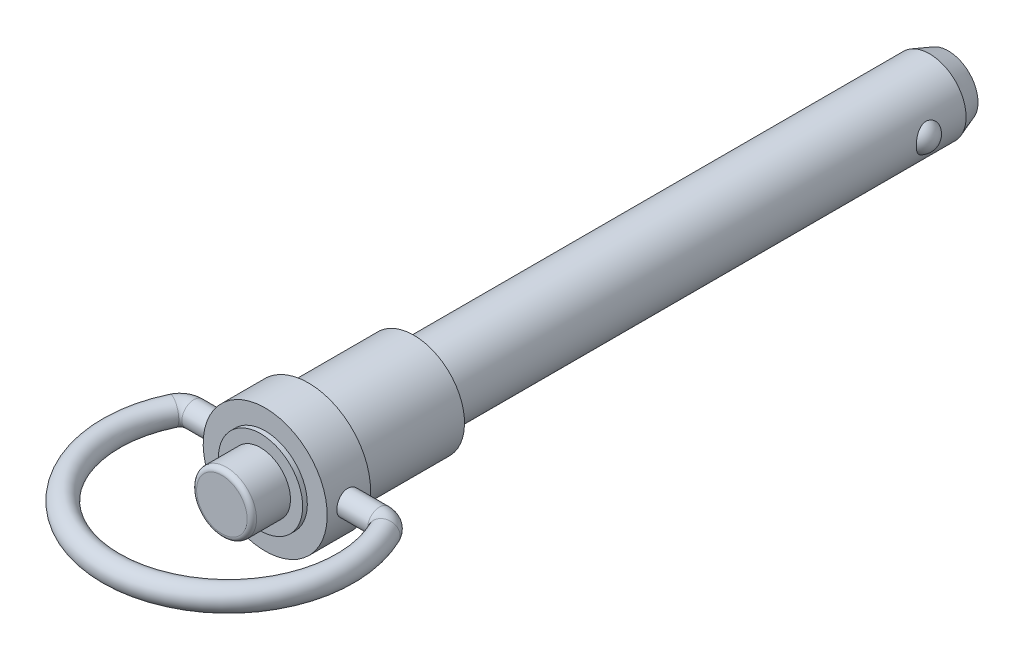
ISO-10303-21;
HEADER;
FILE_DESCRIPTION(('STEP AP214'),'2;1');
FILE_NAME('part.step','',(''),(''),'','','');
FILE_SCHEMA(('AUTOMOTIVE_DESIGN { 1 0 10303 214 1 1 1 1 }'));
ENDSEC;
DATA;
#1=APPLICATION_CONTEXT('core data for automotive mechanical design processes');
#2=APPLICATION_PROTOCOL_DEFINITION('international standard','automotive_design',2000,#1);
#3=PRODUCT_CONTEXT('',#1,'mechanical');
#4=PRODUCT('Part','Part','',(#3));
#5=PRODUCT_RELATED_PRODUCT_CATEGORY('part','',(#4));
#6=PRODUCT_DEFINITION_FORMATION('','',#4);
#7=PRODUCT_DEFINITION_CONTEXT('part definition',#1,'design');
#8=PRODUCT_DEFINITION('design','',#6,#7);
#9=PRODUCT_DEFINITION_SHAPE('','',#8);
#10=(LENGTH_UNIT() NAMED_UNIT(*) SI_UNIT(.MILLI.,.METRE.));
#11=(NAMED_UNIT(*) PLANE_ANGLE_UNIT() SI_UNIT($,.RADIAN.));
#12=(NAMED_UNIT(*) SI_UNIT($,.STERADIAN.) SOLID_ANGLE_UNIT());
#13=UNCERTAINTY_MEASURE_WITH_UNIT(LENGTH_MEASURE(1.E-05),#10,'distance_accuracy_value','');
#14=(GEOMETRIC_REPRESENTATION_CONTEXT(3) GLOBAL_UNCERTAINTY_ASSIGNED_CONTEXT((#13)) GLOBAL_UNIT_ASSIGNED_CONTEXT((#10,
#11,#12)) REPRESENTATION_CONTEXT('',''));
#15=CARTESIAN_POINT('',(0.,0.,0.));
#16=DIRECTION('',(0.,0.,1.));
#17=DIRECTION('',(1.,0.,0.));
#18=AXIS2_PLACEMENT_3D('',#15,#16,#17);
#19=CARTESIAN_POINT('',(0.,0.,20.828));
#20=DIRECTION('',(0.,0.,1.));
#21=DIRECTION('',(0.,-1.,0.));
#22=AXIS2_PLACEMENT_3D('',#19,#20,#21);
#23=PLANE('',#22);
#24=CARTESIAN_POINT('',(0.,0.,20.828));
#25=DIRECTION('',(0.,0.,-1.));
#26=DIRECTION('',(0.,1.,0.));
#27=AXIS2_PLACEMENT_3D('',#24,#25,#26);
#28=CIRCLE('',#27,2.7432);
#29=CARTESIAN_POINT('',(0.,2.7432,20.828));
#30=VERTEX_POINT('',#29);
#31=CARTESIAN_POINT('',(0.,-2.7432,20.828));
#32=VERTEX_POINT('',#31);
#33=EDGE_CURVE('E36',#30,#32,#28,.T.);
#34=ORIENTED_EDGE('',*,*,#33,.F.);
#35=CARTESIAN_POINT('',(0.,0.,20.828));
#36=DIRECTION('',(0.,0.,-1.));
#37=DIRECTION('',(0.,-1.,0.));
#38=AXIS2_PLACEMENT_3D('',#35,#36,#37);
#39=CIRCLE('',#38,2.7432);
#40=EDGE_CURVE('E29',#32,#30,#39,.T.);
#41=ORIENTED_EDGE('',*,*,#40,.F.);
#42=EDGE_LOOP('',(#34,#41));
#43=FACE_BOUND('',#42,.T.);
#44=ADVANCED_FACE('F15',(#43),#23,.T.);
#45=CARTESIAN_POINT('',(0.,0.,20.32));
#46=DIRECTION('',(0.,0.,1.));
#47=DIRECTION('',(0.,-1.,0.));
#48=AXIS2_PLACEMENT_3D('',#45,#46,#47);
#49=TOROIDAL_SURFACE('',#48,2.7432,0.508);
#50=ORIENTED_EDGE('',*,*,#40,.T.);
#51=ORIENTED_EDGE('',*,*,#33,.T.);
#52=EDGE_LOOP('',(#50,#51));
#53=FACE_BOUND('',#52,.T.);
#54=CARTESIAN_POINT('',(0.,0.,20.32));
#55=DIRECTION('',(0.,0.,-1.));
#56=DIRECTION('',(0.,1.,0.));
#57=AXIS2_PLACEMENT_3D('',#54,#55,#56);
#58=CIRCLE('',#57,3.2512);
#59=CARTESIAN_POINT('',(0.,3.2512,20.32));
#60=VERTEX_POINT('',#59);
#61=EDGE_CURVE('E114',#60,#60,#58,.T.);
#62=ORIENTED_EDGE('',*,*,#61,.F.);
#63=EDGE_LOOP('',(#62));
#64=FACE_BOUND('',#63,.T.);
#65=ADVANCED_FACE('F34',(#53,#64),#49,.T.);
#66=CARTESIAN_POINT('',(0.,0.,20.828));
#67=DIRECTION('',(0.,0.,-1.));
#68=DIRECTION('',(0.,1.,0.));
#69=AXIS2_PLACEMENT_3D('',#66,#67,#68);
#70=CYLINDRICAL_SURFACE('',#69,3.2512);
#71=CARTESIAN_POINT('',(0.,0.,16.637));
#72=DIRECTION('',(0.,0.,-1.));
#73=DIRECTION('',(0.,1.,0.));
#74=AXIS2_PLACEMENT_3D('',#71,#72,#73);
#75=CIRCLE('',#74,3.2512);
#76=CARTESIAN_POINT('',(0.,3.2512,16.637));
#77=VERTEX_POINT('',#76);
#78=EDGE_CURVE('E107',#77,#77,#75,.T.);
#79=ORIENTED_EDGE('',*,*,#78,.F.);
#80=EDGE_LOOP('',(#79));
#81=FACE_BOUND('',#80,.T.);
#82=ORIENTED_EDGE('',*,*,#61,.T.);
#83=EDGE_LOOP('',(#82));
#84=FACE_BOUND('',#83,.T.);
#85=ADVANCED_FACE('F90',(#81,#84),#70,.T.);
#86=CARTESIAN_POINT('',(4.572,0.,16.637));
#87=DIRECTION('',(0.,0.,1.));
#88=DIRECTION('',(0.,-1.,0.));
#89=AXIS2_PLACEMENT_3D('',#86,#87,#88);
#90=PLANE('',#89);
#91=ORIENTED_EDGE('',*,*,#78,.T.);
#92=EDGE_LOOP('',(#91));
#93=FACE_BOUND('',#92,.T.);
#94=CARTESIAN_POINT('',(0.,0.,16.637));
#95=DIRECTION('',(0.,0.,-1.));
#96=DIRECTION('',(0.,1.,0.));
#97=AXIS2_PLACEMENT_3D('',#94,#95,#96);
#98=CIRCLE('',#97,4.572);
#99=CARTESIAN_POINT('',(0.,4.572,16.637));
#100=VERTEX_POINT('',#99);
#101=EDGE_CURVE('E106',#100,#100,#98,.T.);
#102=ORIENTED_EDGE('',*,*,#101,.F.);
#103=EDGE_LOOP('',(#102));
#104=FACE_BOUND('',#103,.T.);
#105=ADVANCED_FACE('F93',(#93,#104),#90,.T.);
#106=CARTESIAN_POINT('',(0.,0.,0.));
#107=DIRECTION('',(0.,0.,-1.));
#108=DIRECTION('',(0.,1.,0.));
#109=AXIS2_PLACEMENT_3D('',#106,#107,#108);
#110=CYLINDRICAL_SURFACE('',#109,4.572);
#111=ORIENTED_EDGE('',*,*,#101,.T.);
#112=EDGE_LOOP('',(#111));
#113=FACE_BOUND('',#112,.T.);
#114=CARTESIAN_POINT('',(0.,0.,16.129));
#115=DIRECTION('',(0.,0.,-1.));
#116=DIRECTION('',(0.,1.,0.));
#117=AXIS2_PLACEMENT_3D('',#114,#115,#116);
#118=CIRCLE('',#117,4.572);
#119=CARTESIAN_POINT('',(0.,4.572,16.129));
#120=VERTEX_POINT('',#119);
#121=EDGE_CURVE('E134',#120,#120,#118,.T.);
#122=ORIENTED_EDGE('',*,*,#121,.F.);
#123=EDGE_LOOP('',(#122));
#124=FACE_BOUND('',#123,.T.);
#125=ADVANCED_FACE('F273',(#113,#124),#110,.T.);
#126=CARTESIAN_POINT('',(6.731,0.,16.129));
#127=DIRECTION('',(0.,0.,1.));
#128=DIRECTION('',(0.,-1.,0.));
#129=AXIS2_PLACEMENT_3D('',#126,#127,#128);
#130=PLANE('',#129);
#131=CARTESIAN_POINT('',(0.,0.,16.129));
#132=DIRECTION('',(0.,0.,-1.));
#133=DIRECTION('',(0.,1.,0.));
#134=AXIS2_PLACEMENT_3D('',#131,#132,#133);
#135=CIRCLE('',#134,6.731);
#136=CARTESIAN_POINT('',(0.,6.731,16.129));
#137=VERTEX_POINT('',#136);
#138=EDGE_CURVE('E131',#137,#137,#135,.T.);
#139=ORIENTED_EDGE('',*,*,#138,.F.);
#140=EDGE_LOOP('',(#139));
#141=FACE_BOUND('',#140,.T.);
#142=ORIENTED_EDGE('',*,*,#121,.T.);
#143=EDGE_LOOP('',(#142));
#144=FACE_BOUND('',#143,.T.);
#145=ADVANCED_FACE('F155',(#141,#144),#130,.T.);
#146=CARTESIAN_POINT('',(0.,0.,0.));
#147=DIRECTION('',(0.,0.,-1.));
#148=DIRECTION('',(0.,1.,0.));
#149=AXIS2_PLACEMENT_3D('',#146,#147,#148);
#150=CYLINDRICAL_SURFACE('',#149,6.731);
#151=CARTESIAN_POINT('',(0.,0.,11.43));
#152=DIRECTION('',(0.,0.,-1.));
#153=DIRECTION('',(0.,1.,0.));
#154=AXIS2_PLACEMENT_3D('',#151,#152,#153);
#155=CIRCLE('',#154,6.731);
#156=CARTESIAN_POINT('',(0.,6.731,11.43));
#157=VERTEX_POINT('',#156);
#158=EDGE_CURVE('E122',#157,#157,#155,.T.);
#159=ORIENTED_EDGE('',*,*,#158,.F.);
#160=EDGE_LOOP('',(#159));
#161=FACE_BOUND('',#160,.T.);
#162=ORIENTED_EDGE('',*,*,#138,.T.);
#163=EDGE_LOOP('',(#162));
#164=FACE_BOUND('',#163,.T.);
#165=CARTESIAN_POINT('',(-6.6051722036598,1.2954,13.7922));
#166=CARTESIAN_POINT('',(-6.60517361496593,1.2953972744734,13.864236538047));
#167=CARTESIAN_POINT('',(-6.60636346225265,1.28937073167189,13.9363080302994));
#168=CARTESIAN_POINT('',(-6.61098794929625,1.26544153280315,14.0784162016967));
#169=CARTESIAN_POINT('',(-6.61442445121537,1.2475290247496,14.1484511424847));
#170=CARTESIAN_POINT('',(-6.62313895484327,1.20040052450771,14.2844095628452));
#171=CARTESIAN_POINT('',(-6.62841519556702,1.17119533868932,14.3503369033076));
#172=CARTESIAN_POINT('',(-6.64021258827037,1.10233951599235,14.4763528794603));
#173=CARTESIAN_POINT('',(-6.64673365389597,1.06268960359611,14.5364419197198));
#174=CARTESIAN_POINT('',(-6.66038139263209,0.973516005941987,14.6498669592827));
#175=CARTESIAN_POINT('',(-6.66751428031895,0.9238817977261,14.7031153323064));
#176=CARTESIAN_POINT('',(-6.68152715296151,0.816387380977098,14.8005834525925));
#177=CARTESIAN_POINT('',(-6.6884071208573,0.758526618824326,14.8448025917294));
#178=CARTESIAN_POINT('',(-6.7012057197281,0.63564414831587,14.9232944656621));
#179=CARTESIAN_POINT('',(-6.70711617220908,0.570568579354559,14.9574843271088));
#180=CARTESIAN_POINT('',(-6.71724013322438,0.435464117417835,15.014412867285));
#181=CARTESIAN_POINT('',(-6.72145378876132,0.365435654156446,15.0371525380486));
#182=CARTESIAN_POINT('',(-6.72766549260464,0.22332182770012,15.0702635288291));
#183=CARTESIAN_POINT('',(-6.72968999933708,0.151272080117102,15.0807826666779));
#184=CARTESIAN_POINT('',(-6.73138656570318,0.00640388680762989,15.089614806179));
#185=CARTESIAN_POINT('',(-6.73105883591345,-0.0664144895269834,15.0879289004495));
#186=CARTESIAN_POINT('',(-6.72810846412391,-0.209738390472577,15.072511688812));
#187=CARTESIAN_POINT('',(-6.72551615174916,-0.280261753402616,15.0589395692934));
#188=CARTESIAN_POINT('',(-6.71836197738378,-0.418011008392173,15.0203872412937));
#189=CARTESIAN_POINT('',(-6.71380004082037,-0.485236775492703,14.9954066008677));
#190=CARTESIAN_POINT('',(-6.70316878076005,-0.614941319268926,14.9345963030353));
#191=CARTESIAN_POINT('',(-6.69709072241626,-0.677389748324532,14.8987035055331));
#192=CARTESIAN_POINT('',(-6.68409856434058,-0.795436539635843,14.8171343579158));
#193=CARTESIAN_POINT('',(-6.677184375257,-0.851034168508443,14.7714569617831));
#194=CARTESIAN_POINT('',(-6.66315320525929,-0.954744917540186,14.6707395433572));
#195=CARTESIAN_POINT('',(-6.65603475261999,-1.00272266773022,14.6155602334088));
#196=CARTESIAN_POINT('',(-6.64250376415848,-1.08876420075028,14.4978679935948));
#197=CARTESIAN_POINT('',(-6.63609123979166,-1.12682782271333,14.4353549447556));
#198=CARTESIAN_POINT('',(-6.62469571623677,-1.19200234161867,14.3045844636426));
#199=CARTESIAN_POINT('',(-6.61971540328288,-1.21909269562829,14.2363165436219));
#200=CARTESIAN_POINT('',(-6.61178862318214,-1.26138008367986,14.0960804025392));
#201=CARTESIAN_POINT('',(-6.60884191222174,-1.27657854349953,14.0241126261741));
#202=CARTESIAN_POINT('',(-6.60536444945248,-1.29445125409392,13.8797427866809));
#203=CARTESIAN_POINT('',(-6.60479610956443,-1.29732037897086,13.8073657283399));
#204=CARTESIAN_POINT('',(-6.60603903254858,-1.29097613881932,13.6631669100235));
#205=CARTESIAN_POINT('',(-6.60785017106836,-1.28176340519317,13.5913451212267));
#206=CARTESIAN_POINT('',(-6.6136128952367,-1.25168453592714,13.4509418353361));
#207=CARTESIAN_POINT('',(-6.61754556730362,-1.23092132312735,13.3823374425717));
#208=CARTESIAN_POINT('',(-6.62709183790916,-1.17844042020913,13.249581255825));
#209=CARTESIAN_POINT('',(-6.63270556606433,-1.14672188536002,13.1854298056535));
#210=CARTESIAN_POINT('',(-6.6450665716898,-1.07278507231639,13.0625442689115));
#211=CARTESIAN_POINT('',(-6.65182676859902,-1.03044414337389,13.0038853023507));
#212=CARTESIAN_POINT('',(-6.66568301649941,-0.936629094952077,12.8944341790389));
#213=CARTESIAN_POINT('',(-6.67277909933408,-0.885154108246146,12.8436427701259));
#214=CARTESIAN_POINT('',(-6.68662882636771,-0.773660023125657,12.7506362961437));
#215=CARTESIAN_POINT('',(-6.69337621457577,-0.713530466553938,12.7085525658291));
#216=CARTESIAN_POINT('',(-6.70566168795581,-0.586941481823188,12.6350847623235));
#217=CARTESIAN_POINT('',(-6.71119982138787,-0.520482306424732,12.6037002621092));
#218=CARTESIAN_POINT('',(-6.72041595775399,-0.383476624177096,12.5527164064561));
#219=CARTESIAN_POINT('',(-6.72410395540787,-0.312954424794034,12.5330536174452));
#220=CARTESIAN_POINT('',(-6.72924701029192,-0.169530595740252,12.5058694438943));
#221=CARTESIAN_POINT('',(-6.7307023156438,-0.096629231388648,12.4983467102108));
#222=CARTESIAN_POINT('',(-6.73121071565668,0.0482259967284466,12.4957052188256));
#223=CARTESIAN_POINT('',(-6.73030215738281,0.120176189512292,12.5003884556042));
#224=CARTESIAN_POINT('',(-6.72626496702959,0.262244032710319,12.5215909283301));
#225=CARTESIAN_POINT('',(-6.72313635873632,0.332361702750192,12.5381100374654));
#226=CARTESIAN_POINT('',(-6.71501101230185,0.468662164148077,12.5824301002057));
#227=CARTESIAN_POINT('',(-6.710017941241,0.534852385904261,12.6102089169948));
#228=CARTESIAN_POINT('',(-6.69870305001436,0.661661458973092,12.6762356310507));
#229=CARTESIAN_POINT('',(-6.69238113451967,0.722279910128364,12.7144842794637));
#230=CARTESIAN_POINT('',(-6.6789853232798,0.837208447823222,12.8010411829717));
#231=CARTESIAN_POINT('',(-6.67190155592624,0.891410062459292,12.8494919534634));
#232=CARTESIAN_POINT('',(-6.65784127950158,0.990982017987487,12.95478313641));
#233=CARTESIAN_POINT('',(-6.65086479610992,1.03635027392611,13.0116255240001));
#234=CARTESIAN_POINT('',(-6.63773378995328,1.11738877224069,13.1327559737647));
#235=CARTESIAN_POINT('',(-6.63158802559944,1.15295925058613,13.1971117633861));
#236=CARTESIAN_POINT('',(-6.62092027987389,1.21272619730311,13.3309847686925));
#237=CARTESIAN_POINT('',(-6.61639678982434,1.23693323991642,13.4004971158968));
#238=CARTESIAN_POINT('',(-6.61041337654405,1.26845390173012,13.5238636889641));
#239=CARTESIAN_POINT('',(-6.60845980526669,1.27854107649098,13.57700269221));
#240=CARTESIAN_POINT('',(-6.60583870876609,1.29201504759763,13.6841545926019));
#241=CARTESIAN_POINT('',(-6.60517114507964,1.29540204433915,13.7381674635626));
#242=CARTESIAN_POINT('',(-6.6051722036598,1.2954,13.7922));
#243=B_SPLINE_CURVE_WITH_KNOTS('',3,(#165,#166,#167,#168,#169,#170,#171,#172,#173,#174,#175,
#176,#177,#178,#179,#180,#181,#182,#183,#184,#185,#186,#187,#188,#189,#190,#191,#192,#193,#194,
#195,#196,#197,#198,#199,#200,#201,#202,#203,#204,#205,#206,#207,#208,#209,#210,#211,#212,#213,
#214,#215,#216,#217,#218,#219,#220,#221,#222,#223,#224,#225,#226,#227,#228,#229,#230,#231,#232,
#233,#234,#235,#236,#237,#238,#239,#240,#241,#242),.UNSPECIFIED.,.T.,.F.,(4,2,2,2,2,2,2,2,2,2,2,
2,2,2,2,2,2,2,2,2,2,2,2,2,2,2,2,2,2,2,2,2,2,2,2,2,2,2,4),(0.,0.215911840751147,
0.432002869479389,0.64788762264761,0.86375740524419,1.08216318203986,1.30058366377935,
1.52076118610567,1.74091962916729,1.95838638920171,2.1758336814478,2.39041258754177,
2.60499961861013,2.82085272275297,3.0367289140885,3.25609136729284,3.47545737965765,
3.69523218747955,3.91498064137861,4.13124273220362,4.34749352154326,4.56184753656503,
4.7762180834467,4.99318797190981,5.21017847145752,5.430235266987,5.65028327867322,
5.86912939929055,6.08795119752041,6.30324544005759,6.51853737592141,6.73340808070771,
6.94829420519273,7.16640910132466,7.38457541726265,7.60488731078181,7.82499378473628,
7.98694789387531,8.14889715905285),.UNSPECIFIED.);
#244=CARTESIAN_POINT('',(-6.6051722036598,1.2954,13.7922));
#245=VERTEX_POINT('',#244);
#246=EDGE_CURVE('E366',#245,#245,#243,.T.);
#247=ORIENTED_EDGE('',*,*,#246,.T.);
#248=EDGE_LOOP('',(#247));
#249=FACE_BOUND('',#248,.T.);
#250=CARTESIAN_POINT('',(6.6051722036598,1.2954,13.7922));
#251=CARTESIAN_POINT('',(6.60517361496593,1.2953972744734,13.720163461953));
#252=CARTESIAN_POINT('',(6.60636346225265,1.2893707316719,13.6480919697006));
#253=CARTESIAN_POINT('',(6.61098794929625,1.26544153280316,13.5059837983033));
#254=CARTESIAN_POINT('',(6.61442445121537,1.24752902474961,13.4359488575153));
#255=CARTESIAN_POINT('',(6.62313895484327,1.20040052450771,13.2999904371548));
#256=CARTESIAN_POINT('',(6.62841519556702,1.17119533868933,13.2340630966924));
#257=CARTESIAN_POINT('',(6.64021258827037,1.10233951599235,13.1080471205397));
#258=CARTESIAN_POINT('',(6.64673365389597,1.06268960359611,13.0479580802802));
#259=CARTESIAN_POINT('',(6.66038139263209,0.973516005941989,12.9345330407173));
#260=CARTESIAN_POINT('',(6.66751428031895,0.923881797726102,12.8812846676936));
#261=CARTESIAN_POINT('',(6.68152715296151,0.816387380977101,12.7838165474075));
#262=CARTESIAN_POINT('',(6.6884071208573,0.758526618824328,12.7395974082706));
#263=CARTESIAN_POINT('',(6.7012057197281,0.635644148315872,12.6611055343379));
#264=CARTESIAN_POINT('',(6.70711617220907,0.570568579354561,12.6269156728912));
#265=CARTESIAN_POINT('',(6.71724013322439,0.435464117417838,12.569987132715));
#266=CARTESIAN_POINT('',(6.72145378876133,0.365435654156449,12.5472474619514));
#267=CARTESIAN_POINT('',(6.72766549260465,0.223321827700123,12.5141364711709));
#268=CARTESIAN_POINT('',(6.72968999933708,0.151272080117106,12.5036173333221));
#269=CARTESIAN_POINT('',(6.73138656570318,0.00640388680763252,12.494785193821));
#270=CARTESIAN_POINT('',(6.73105883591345,-0.0664144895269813,12.4964710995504));
#271=CARTESIAN_POINT('',(6.72810846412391,-0.209738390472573,12.511888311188));
#272=CARTESIAN_POINT('',(6.72551615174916,-0.280261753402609,12.5254604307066));
#273=CARTESIAN_POINT('',(6.71836197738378,-0.418011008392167,12.5640127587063));
#274=CARTESIAN_POINT('',(6.71380004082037,-0.485236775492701,12.5889933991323));
#275=CARTESIAN_POINT('',(6.70316878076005,-0.614941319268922,12.6498036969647));
#276=CARTESIAN_POINT('',(6.69709072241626,-0.677389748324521,12.6856964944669));
#277=CARTESIAN_POINT('',(6.68409856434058,-0.795436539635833,12.7672656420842));
#278=CARTESIAN_POINT('',(6.677184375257,-0.851034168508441,12.8129430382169));
#279=CARTESIAN_POINT('',(6.66315320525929,-0.954744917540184,12.9136604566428));
#280=CARTESIAN_POINT('',(6.65603475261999,-1.00272266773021,12.9688397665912));
#281=CARTESIAN_POINT('',(6.64250376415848,-1.08876420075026,13.0865320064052));
#282=CARTESIAN_POINT('',(6.63609123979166,-1.12682782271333,13.1490450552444));
#283=CARTESIAN_POINT('',(6.62469571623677,-1.19200234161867,13.2798155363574));
#284=CARTESIAN_POINT('',(6.61971540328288,-1.21909269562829,13.3480834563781));
#285=CARTESIAN_POINT('',(6.61178862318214,-1.26138008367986,13.4883195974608));
#286=CARTESIAN_POINT('',(6.60884191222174,-1.27657854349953,13.5602873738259));
#287=CARTESIAN_POINT('',(6.60536444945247,-1.29445125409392,13.7046572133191));
#288=CARTESIAN_POINT('',(6.60479610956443,-1.29732037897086,13.7770342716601));
#289=CARTESIAN_POINT('',(6.60603903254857,-1.29097613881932,13.9212330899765));
#290=CARTESIAN_POINT('',(6.60785017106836,-1.28176340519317,13.9930548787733));
#291=CARTESIAN_POINT('',(6.6136128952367,-1.25168453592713,14.1334581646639));
#292=CARTESIAN_POINT('',(6.61754556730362,-1.23092132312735,14.2020625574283));
#293=CARTESIAN_POINT('',(6.62709183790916,-1.17844042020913,14.334818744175));
#294=CARTESIAN_POINT('',(6.63270556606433,-1.14672188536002,14.3989701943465));
#295=CARTESIAN_POINT('',(6.6450665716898,-1.07278507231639,14.5218557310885));
#296=CARTESIAN_POINT('',(6.65182676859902,-1.03044414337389,14.5805146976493));
#297=CARTESIAN_POINT('',(6.66568301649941,-0.936629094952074,14.6899658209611));
#298=CARTESIAN_POINT('',(6.67277909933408,-0.885154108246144,14.7407572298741));
#299=CARTESIAN_POINT('',(6.6866288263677,-0.773660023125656,14.8337637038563));
#300=CARTESIAN_POINT('',(6.69337621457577,-0.713530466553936,14.8758474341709));
#301=CARTESIAN_POINT('',(6.70566168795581,-0.586941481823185,14.9493152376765));
#302=CARTESIAN_POINT('',(6.71119982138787,-0.52048230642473,14.9806997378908));
#303=CARTESIAN_POINT('',(6.72041595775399,-0.383476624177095,15.0316835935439));
#304=CARTESIAN_POINT('',(6.72410395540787,-0.312954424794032,15.0513463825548));
#305=CARTESIAN_POINT('',(6.72924701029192,-0.169530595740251,15.0785305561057));
#306=CARTESIAN_POINT('',(6.7307023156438,-0.0966292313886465,15.0860532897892));
#307=CARTESIAN_POINT('',(6.73121071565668,0.0482259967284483,15.0886947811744));
#308=CARTESIAN_POINT('',(6.73030215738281,0.120176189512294,15.0840115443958));
#309=CARTESIAN_POINT('',(6.72626496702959,0.26224403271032,15.0628090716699));
#310=CARTESIAN_POINT('',(6.72313635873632,0.332361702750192,15.0462899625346));
#311=CARTESIAN_POINT('',(6.71501101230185,0.468662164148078,15.0019698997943));
#312=CARTESIAN_POINT('',(6.710017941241,0.534852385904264,14.9741910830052));
#313=CARTESIAN_POINT('',(6.69870305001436,0.661661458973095,14.9081643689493));
#314=CARTESIAN_POINT('',(6.69238113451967,0.722279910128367,14.8699157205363));
#315=CARTESIAN_POINT('',(6.6789853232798,0.837208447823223,14.7833588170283));
#316=CARTESIAN_POINT('',(6.67190155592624,0.891410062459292,14.7349080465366));
#317=CARTESIAN_POINT('',(6.65784127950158,0.990982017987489,14.62961686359));
#318=CARTESIAN_POINT('',(6.65086479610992,1.03635027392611,14.5727744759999));
#319=CARTESIAN_POINT('',(6.63773378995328,1.1173887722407,14.4516440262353));
#320=CARTESIAN_POINT('',(6.63158802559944,1.15295925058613,14.3872882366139));
#321=CARTESIAN_POINT('',(6.62092027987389,1.21272619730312,14.2534152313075));
#322=CARTESIAN_POINT('',(6.61639678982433,1.23693323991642,14.1839028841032));
#323=CARTESIAN_POINT('',(6.61041337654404,1.26845390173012,14.0605363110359));
#324=CARTESIAN_POINT('',(6.60845980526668,1.27854107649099,14.00739730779));
#325=CARTESIAN_POINT('',(6.60583870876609,1.29201504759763,13.9002454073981));
#326=CARTESIAN_POINT('',(6.60517114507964,1.29540204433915,13.8462325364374));
#327=CARTESIAN_POINT('',(6.6051722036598,1.2954,13.7922));
#328=B_SPLINE_CURVE_WITH_KNOTS('',3,(#250,#251,#252,#253,#254,#255,#256,#257,#258,#259,#260,
#261,#262,#263,#264,#265,#266,#267,#268,#269,#270,#271,#272,#273,#274,#275,#276,#277,#278,#279,
#280,#281,#282,#283,#284,#285,#286,#287,#288,#289,#290,#291,#292,#293,#294,#295,#296,#297,#298,
#299,#300,#301,#302,#303,#304,#305,#306,#307,#308,#309,#310,#311,#312,#313,#314,#315,#316,#317,
#318,#319,#320,#321,#322,#323,#324,#325,#326,#327),.UNSPECIFIED.,.T.,.F.,(4,2,2,2,2,2,2,2,2,2,2,
2,2,2,2,2,2,2,2,2,2,2,2,2,2,2,2,2,2,2,2,2,2,2,2,2,2,2,4),(0.,0.215911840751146,
0.432002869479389,0.647887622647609,0.86375740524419,1.08216318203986,1.30058366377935,
1.52076118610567,1.74091962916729,1.95838638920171,2.1758336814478,2.39041258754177,
2.60499961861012,2.82085272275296,3.03672891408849,3.25609136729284,3.47545737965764,
3.69523218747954,3.91498064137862,4.13124273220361,4.34749352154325,4.56184753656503,
4.77621808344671,4.99318797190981,5.21017847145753,5.43023526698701,5.65028327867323,
5.86912939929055,6.08795119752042,6.30324544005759,6.51853737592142,6.73340808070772,
6.94829420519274,7.16640910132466,7.38457541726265,7.60488731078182,7.82499378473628,
7.98694789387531,8.14889715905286),.UNSPECIFIED.);
#329=CARTESIAN_POINT('',(6.6051722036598,1.2954,13.7922));
#330=VERTEX_POINT('',#329);
#331=EDGE_CURVE('E210',#330,#330,#328,.T.);
#332=ORIENTED_EDGE('',*,*,#331,.T.);
#333=EDGE_LOOP('',(#332));
#334=FACE_BOUND('',#333,.T.);
#335=ADVANCED_FACE('F149',(#161,#164,#249,#334),#150,.T.);
#336=CARTESIAN_POINT('',(5.7785,0.,11.43));
#337=DIRECTION('',(0.,0.,-1.));
#338=DIRECTION('',(0.,1.,0.));
#339=AXIS2_PLACEMENT_3D('',#336,#337,#338);
#340=PLANE('',#339);
#341=CARTESIAN_POINT('',(0.,0.,11.43));
#342=DIRECTION('',(0.,0.,-1.));
#343=DIRECTION('',(0.,1.,0.));
#344=AXIS2_PLACEMENT_3D('',#341,#342,#343);
#345=CIRCLE('',#344,5.9);
#346=CARTESIAN_POINT('',(0.,5.9,11.43));
#347=VERTEX_POINT('',#346);
#348=EDGE_CURVE('E23',#347,#347,#345,.F.);
#349=ORIENTED_EDGE('',*,*,#348,.T.);
#350=EDGE_LOOP('',(#349));
#351=FACE_BOUND('',#350,.T.);
#352=ORIENTED_EDGE('',*,*,#158,.T.);
#353=EDGE_LOOP('',(#352));
#354=FACE_BOUND('',#353,.T.);
#355=ADVANCED_FACE('F88',(#351,#354),#340,.T.);
#356=CARTESIAN_POINT('',(10.0803124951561,0.,15.3162));
#357=DIRECTION('',(0.,1.,0.));
#358=DIRECTION('',(-1.,0.,0.));
#359=AXIS2_PLACEMENT_3D('',#356,#357,#358);
#360=TOROIDAL_SURFACE('',#359,1.524,1.2954);
#361=CARTESIAN_POINT('',(11.4549005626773,0.,14.658109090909));
#362=DIRECTION('',(-0.431818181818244,0.,-0.901960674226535));
#363=DIRECTION('',(0.901960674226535,0.,-0.431818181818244));
#364=AXIS2_PLACEMENT_3D('',#361,#362,#363);
#365=CIRCLE('',#364,1.2954);
#366=CARTESIAN_POINT('',(12.6233004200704,0.,14.0987318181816));
#367=VERTEX_POINT('',#366);
#368=EDGE_CURVE('E42',#367,#367,#365,.T.);
#369=ORIENTED_EDGE('',*,*,#368,.T.);
#370=EDGE_LOOP('',(#369));
#371=FACE_BOUND('',#370,.T.);
#372=CARTESIAN_POINT('',(10.0803124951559,0.,13.7922));
#373=DIRECTION('',(1.,0.,0.));
#374=DIRECTION('',(0.,1.,0.));
#375=AXIS2_PLACEMENT_3D('',#372,#373,#374);
#376=CIRCLE('',#375,1.2954);
#377=CARTESIAN_POINT('',(10.0803124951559,1.2954,13.7922));
#378=VERTEX_POINT('',#377);
#379=EDGE_CURVE('E108',#378,#378,#376,.F.);
#380=ORIENTED_EDGE('',*,*,#379,.F.);
#381=EDGE_LOOP('',(#380));
#382=FACE_BOUND('',#381,.T.);
#383=ADVANCED_FACE('F60',(#371,#382),#360,.T.);
#384=CARTESIAN_POINT('',(-10.0803124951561,0.,13.7922));
#385=DIRECTION('',(1.,0.,0.));
#386=DIRECTION('',(0.,1.,0.));
#387=AXIS2_PLACEMENT_3D('',#384,#385,#386);
#388=CYLINDRICAL_SURFACE('',#387,1.2954);
#389=ORIENTED_EDGE('',*,*,#331,.F.);
#390=EDGE_LOOP('',(#389));
#391=FACE_BOUND('',#390,.T.);
#392=ORIENTED_EDGE('',*,*,#379,.T.);
#393=EDGE_LOOP('',(#392));
#394=FACE_BOUND('',#393,.T.);
#395=ADVANCED_FACE('F84',(#391,#394),#388,.T.);
#396=CARTESIAN_POINT('',(0.,0.,20.1422));
#397=DIRECTION('',(0.,1.,0.));
#398=DIRECTION('',(-1.,0.,0.));
#399=AXIS2_PLACEMENT_3D('',#396,#397,#398);
#400=TOROIDAL_SURFACE('',#399,12.7,1.2954);
#401=CARTESIAN_POINT('',(-11.4549005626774,0.,14.6581090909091));
#402=DIRECTION('',(-0.43181818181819,0.,0.901960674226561));
#403=DIRECTION('',(-0.901960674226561,0.,-0.43181818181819));
#404=AXIS2_PLACEMENT_3D('',#401,#402,#403);
#405=CIRCLE('',#404,1.2954);
#406=CARTESIAN_POINT('',(-12.6233004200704,0.,14.0987318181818));
#407=VERTEX_POINT('',#406);
#408=EDGE_CURVE('E111',#407,#407,#405,.F.);
#409=ORIENTED_EDGE('',*,*,#408,.F.);
#410=EDGE_LOOP('',(#409));
#411=FACE_BOUND('',#410,.T.);
#412=ORIENTED_EDGE('',*,*,#368,.F.);
#413=EDGE_LOOP('',(#412));
#414=FACE_BOUND('',#413,.T.);
#415=ADVANCED_FACE('F80',(#411,#414),#400,.T.);
#416=CARTESIAN_POINT('',(-10.0803124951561,0.,15.3162));
#417=DIRECTION('',(0.,1.,0.));
#418=DIRECTION('',(-1.,0.,0.));
#419=AXIS2_PLACEMENT_3D('',#416,#417,#418);
#420=TOROIDAL_SURFACE('',#419,1.524,1.2954);
#421=CARTESIAN_POINT('',(-10.0803124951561,0.,13.7922));
#422=DIRECTION('',(1.,0.,0.));
#423=DIRECTION('',(0.,1.,0.));
#424=AXIS2_PLACEMENT_3D('',#421,#422,#423);
#425=CIRCLE('',#424,1.2954);
#426=CARTESIAN_POINT('',(-10.0803124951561,1.2954,13.7922));
#427=VERTEX_POINT('',#426);
#428=EDGE_CURVE('E103',#427,#427,#425,.T.);
#429=ORIENTED_EDGE('',*,*,#428,.F.);
#430=EDGE_LOOP('',(#429));
#431=FACE_BOUND('',#430,.T.);
#432=ORIENTED_EDGE('',*,*,#408,.T.);
#433=EDGE_LOOP('',(#432));
#434=FACE_BOUND('',#433,.T.);
#435=ADVANCED_FACE('F83',(#431,#434),#420,.T.);
#436=CARTESIAN_POINT('',(-10.0803124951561,0.,13.7922));
#437=DIRECTION('',(1.,0.,0.));
#438=DIRECTION('',(0.,1.,0.));
#439=AXIS2_PLACEMENT_3D('',#436,#437,#438);
#440=CYLINDRICAL_SURFACE('',#439,1.2954);
#441=ORIENTED_EDGE('',*,*,#246,.F.);
#442=EDGE_LOOP('',(#441));
#443=FACE_BOUND('',#442,.T.);
#444=ORIENTED_EDGE('',*,*,#428,.T.);
#445=EDGE_LOOP('',(#444));
#446=FACE_BOUND('',#445,.T.);
#447=ADVANCED_FACE('F97',(#443,#446),#440,.T.);
#448=CARTESIAN_POINT('',(0.,0.,34.5180955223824));
#449=DIRECTION('',(0.,0.,-1.));
#450=DIRECTION('',(0.,1.,0.));
#451=AXIS2_PLACEMENT_3D('',#448,#449,#450);
#452=CYLINDRICAL_SURFACE('',#451,5.5);
#453=CARTESIAN_POINT('',(0.,0.,11.03));
#454=DIRECTION('',(0.,0.,-1.));
#455=DIRECTION('',(0.,1.,0.));
#456=AXIS2_PLACEMENT_3D('',#453,#454,#455);
#457=CIRCLE('',#456,5.5);
#458=CARTESIAN_POINT('',(0.,5.5,11.03));
#459=VERTEX_POINT('',#458);
#460=EDGE_CURVE('E9',#459,#459,#457,.T.);
#461=ORIENTED_EDGE('',*,*,#460,.T.);
#462=EDGE_LOOP('',(#461));
#463=FACE_BOUND('',#462,.T.);
#464=CARTESIAN_POINT('',(0.,0.,0.));
#465=DIRECTION('',(0.,0.,-1.));
#466=DIRECTION('',(0.,1.,0.));
#467=AXIS2_PLACEMENT_3D('',#464,#465,#466);
#468=CIRCLE('',#467,5.5);
#469=CARTESIAN_POINT('',(0.,5.5,0.));
#470=VERTEX_POINT('',#469);
#471=EDGE_CURVE('E191',#470,#470,#468,.T.);
#472=ORIENTED_EDGE('',*,*,#471,.F.);
#473=EDGE_LOOP('',(#472));
#474=FACE_BOUND('',#473,.T.);
#475=ADVANCED_FACE('F266',(#463,#474),#452,.T.);
#476=CARTESIAN_POINT('',(3.22979748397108,0.,-57.9908));
#477=DIRECTION('',(0.,0.,1.));
#478=DIRECTION('',(0.,-1.,0.));
#479=AXIS2_PLACEMENT_3D('',#476,#477,#478);
#480=PLANE('',#479);
#481=CARTESIAN_POINT('',(0.,0.,-57.9907999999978));
#482=DIRECTION('',(0.,0.,1.));
#483=DIRECTION('',(0.,-1.,0.));
#484=AXIS2_PLACEMENT_3D('',#481,#482,#483);
#485=CIRCLE('',#484,3.22979748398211);
#486=CARTESIAN_POINT('',(0.,-3.22979748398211,-57.9907999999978));
#487=VERTEX_POINT('',#486);
#488=EDGE_CURVE('E45',#487,#487,#485,.T.);
#489=ORIENTED_EDGE('',*,*,#488,.F.);
#490=EDGE_LOOP('',(#489));
#491=FACE_BOUND('',#490,.T.);
#492=ADVANCED_FACE('F205',(#491),#480,.F.);
#493=CARTESIAN_POINT('',(3.12293,0.,-51.8948));
#494=DIRECTION('',(0.,0.,1.));
#495=DIRECTION('',(1.,0.,0.));
#496=AXIS2_PLACEMENT_3D('',#493,#494,#495);
#497=SPHERICAL_SURFACE('',#496,1.5875);
#498=CARTESIAN_POINT('',(3.969385,0.,-50.5517921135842));
#499=CARTESIAN_POINT('',(3.96938133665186,0.0871787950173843,-50.5517940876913));
#500=CARTESIAN_POINT('',(3.96648576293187,0.174428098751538,-50.5584820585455));
#501=CARTESIAN_POINT('',(3.95516905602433,0.346584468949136,-50.5851998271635));
#502=CARTESIAN_POINT('',(3.94674017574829,0.43148807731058,-50.60524833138));
#503=CARTESIAN_POINT('',(3.92519423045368,0.596479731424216,-50.6585272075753));
#504=CARTESIAN_POINT('',(3.91207555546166,0.676566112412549,-50.6917621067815));
#505=CARTESIAN_POINT('',(3.88253654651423,0.829452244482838,-50.7710588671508));
#506=CARTESIAN_POINT('',(3.86611699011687,0.902253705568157,-50.8171177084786));
#507=CARTESIAN_POINT('',(3.83222363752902,1.03672093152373,-50.9203356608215));
#508=CARTESIAN_POINT('',(3.81477966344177,1.0985904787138,-50.9772380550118));
#509=CARTESIAN_POINT('',(3.78068495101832,1.21073548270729,-51.1017462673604));
#510=CARTESIAN_POINT('',(3.76403384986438,1.26101628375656,-51.1693471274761));
#511=CARTESIAN_POINT('',(3.73507217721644,1.34426479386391,-51.3077911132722));
#512=CARTESIAN_POINT('',(3.72252093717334,1.37829571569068,-51.3779422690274));
#513=CARTESIAN_POINT('',(3.70178973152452,1.43305274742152,-51.5238520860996));
#514=CARTESIAN_POINT('',(3.69360549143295,1.45379187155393,-51.5996051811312));
#515=CARTESIAN_POINT('',(3.68341966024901,1.47939277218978,-51.7454817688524));
#516=CARTESIAN_POINT('',(3.680835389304,1.48575429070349,-51.8153038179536));
#517=CARTESIAN_POINT('',(3.68040725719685,1.48681628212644,-51.9550414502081));
#518=CARTESIAN_POINT('',(3.68256179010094,1.48152070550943,-52.0249569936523));
#519=CARTESIAN_POINT('',(3.69108766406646,1.4601393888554,-52.1588086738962));
#520=CARTESIAN_POINT('',(3.69721728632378,1.44467149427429,-52.2228608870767));
#521=CARTESIAN_POINT('',(3.71278611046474,1.40417367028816,-52.3474287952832));
#522=CARTESIAN_POINT('',(3.72222570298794,1.37914261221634,-52.4079440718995));
#523=CARTESIAN_POINT('',(3.74389633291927,1.3192072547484,-52.5264268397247));
#524=CARTESIAN_POINT('',(3.75622345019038,1.28394990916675,-52.5841973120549));
#525=CARTESIAN_POINT('',(3.78224213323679,1.20514746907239,-52.6934181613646));
#526=CARTESIAN_POINT('',(3.79593412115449,1.1615998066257,-52.7448665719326));
#527=CARTESIAN_POINT('',(3.82484228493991,1.06277839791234,-52.8454045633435));
#528=CARTESIAN_POINT('',(3.84007638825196,1.00677387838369,-52.8937694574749));
#529=CARTESIAN_POINT('',(3.86933265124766,0.887713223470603,-52.9813922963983));
#530=CARTESIAN_POINT('',(3.88335410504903,0.824653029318,-53.0206449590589));
#531=CARTESIAN_POINT('',(3.90318345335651,0.722863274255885,-53.0740110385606));
#532=CARTESIAN_POINT('',(3.90984058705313,0.686009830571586,-53.0914710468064));
#533=CARTESIAN_POINT('',(3.92226926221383,0.610957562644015,-53.123476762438));
#534=CARTESIAN_POINT('',(3.92804156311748,0.572759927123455,-53.1380249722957));
#535=CARTESIAN_POINT('',(3.94381689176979,0.456514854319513,-53.1772484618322));
#536=CARTESIAN_POINT('',(3.95229851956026,0.376714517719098,-53.197554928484));
#537=CARTESIAN_POINT('',(3.96199329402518,0.247044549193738,-53.2205332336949));
#538=CARTESIAN_POINT('',(3.96475587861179,0.19791011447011,-53.2270073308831));
#539=CARTESIAN_POINT('',(3.96845279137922,0.0991914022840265,-53.2356452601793));
#540=CARTESIAN_POINT('',(3.96938708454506,0.0496071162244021,-53.2378090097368));
#541=CARTESIAN_POINT('',(3.96938133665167,-0.0871787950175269,-53.2378059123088));
#542=CARTESIAN_POINT('',(3.96648576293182,-0.174428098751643,-53.2311179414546));
#543=CARTESIAN_POINT('',(3.95516905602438,-0.346584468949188,-53.2044001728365));
#544=CARTESIAN_POINT('',(3.94674017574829,-0.431488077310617,-53.1843516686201));
#545=CARTESIAN_POINT('',(3.92519423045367,-0.596479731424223,-53.1310727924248));
#546=CARTESIAN_POINT('',(3.91207555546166,-0.676566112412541,-53.0978378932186));
#547=CARTESIAN_POINT('',(3.88253654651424,-0.829452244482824,-53.0185411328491));
#548=CARTESIAN_POINT('',(3.86611699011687,-0.902253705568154,-52.9724822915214));
#549=CARTESIAN_POINT('',(3.83222363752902,-1.03672093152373,-52.8692643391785));
#550=CARTESIAN_POINT('',(3.81477966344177,-1.0985904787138,-52.8123619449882));
#551=CARTESIAN_POINT('',(3.78068495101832,-1.21073548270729,-52.6878537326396));
#552=CARTESIAN_POINT('',(3.76403384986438,-1.26101628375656,-52.6202528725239));
#553=CARTESIAN_POINT('',(3.73507217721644,-1.34426479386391,-52.4818088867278));
#554=CARTESIAN_POINT('',(3.72252093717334,-1.37829571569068,-52.4116577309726));
#555=CARTESIAN_POINT('',(3.70178973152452,-1.43305274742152,-52.2657479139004));
#556=CARTESIAN_POINT('',(3.69360549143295,-1.45379187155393,-52.1899948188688));
#557=CARTESIAN_POINT('',(3.68341966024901,-1.47939277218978,-52.0441182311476));
#558=CARTESIAN_POINT('',(3.680835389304,-1.4857542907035,-51.9742961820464));
#559=CARTESIAN_POINT('',(3.68040725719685,-1.48681628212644,-51.8345585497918));
#560=CARTESIAN_POINT('',(3.68256179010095,-1.48152070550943,-51.7646430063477));
#561=CARTESIAN_POINT('',(3.69108766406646,-1.4601393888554,-51.6307913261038));
#562=CARTESIAN_POINT('',(3.69721728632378,-1.4446714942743,-51.5667391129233));
#563=CARTESIAN_POINT('',(3.71278611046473,-1.40417367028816,-51.4421712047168));
#564=CARTESIAN_POINT('',(3.72222570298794,-1.37914261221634,-51.3816559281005));
#565=CARTESIAN_POINT('',(3.74389633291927,-1.31920725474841,-51.2631731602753));
#566=CARTESIAN_POINT('',(3.75622345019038,-1.28394990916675,-51.2054026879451));
#567=CARTESIAN_POINT('',(3.78224213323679,-1.20514746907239,-51.0961818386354));
#568=CARTESIAN_POINT('',(3.79593412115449,-1.1615998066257,-51.0447334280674));
#569=CARTESIAN_POINT('',(3.82484228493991,-1.06277839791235,-50.9441954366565));
#570=CARTESIAN_POINT('',(3.84007638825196,-1.00677387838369,-50.8958305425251));
#571=CARTESIAN_POINT('',(3.86933265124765,-0.887713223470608,-50.8082077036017));
#572=CARTESIAN_POINT('',(3.88335410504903,-0.824653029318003,-50.7689550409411));
#573=CARTESIAN_POINT('',(3.90318345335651,-0.722863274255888,-50.7155889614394));
#574=CARTESIAN_POINT('',(3.90984058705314,-0.686009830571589,-50.6981289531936));
#575=CARTESIAN_POINT('',(3.92226926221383,-0.610957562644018,-50.666123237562));
#576=CARTESIAN_POINT('',(3.92804156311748,-0.572759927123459,-50.6515750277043));
#577=CARTESIAN_POINT('',(3.94381689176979,-0.456514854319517,-50.6123515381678));
#578=CARTESIAN_POINT('',(3.95229851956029,-0.3767145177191,-50.5920450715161));
#579=CARTESIAN_POINT('',(3.96199329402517,-0.247044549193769,-50.5690667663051));
#580=CARTESIAN_POINT('',(3.96475587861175,-0.197910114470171,-50.5625926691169));
#581=CARTESIAN_POINT('',(3.96845279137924,-0.0991914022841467,-50.5539547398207));
#582=CARTESIAN_POINT('',(3.96938708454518,-0.0496071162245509,-50.5517909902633));
#583=CARTESIAN_POINT('',(3.969385,0.,-50.5517921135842));
#584=B_SPLINE_CURVE_WITH_KNOTS('',3,(#498,#499,#500,#501,#502,#503,#504,#505,#506,#507,#508,
#509,#510,#511,#512,#513,#514,#515,#516,#517,#518,#519,#520,#521,#522,#523,#524,#525,#526,#527,
#528,#529,#530,#531,#532,#533,#534,#535,#536,#537,#538,#539,#540,#541,#542,#543,#544,#545,#546,
#547,#548,#549,#550,#551,#552,#553,#554,#555,#556,#557,#558,#559,#560,#561,#562,#563,#564,#565,
#566,#567,#568,#569,#570,#571,#572,#573,#574,#575,#576,#577,#578,#579,#580,#581,#582,#583),
.UNSPECIFIED.,.T.,.F.,(4,2,2,2,2,2,2,2,2,2,2,2,2,2,2,2,2,2,2,2,2,2,2,2,2,2,2,2,2,2,2,2,2,2,2,2,
2,2,2,2,2,2,4),(0.,0.261355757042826,0.523078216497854,0.78489060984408,1.04664140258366,
1.30282923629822,1.5588986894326,1.79448362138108,2.02983753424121,2.23921556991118,
2.44852266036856,2.64616391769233,2.84382850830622,3.04935366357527,3.25494258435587,
3.48066948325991,3.70652690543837,3.8303651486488,3.95409650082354,4.20121716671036,
4.34993288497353,4.49865145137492,4.76000720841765,5.02172966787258,5.28354206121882,
5.54529285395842,5.80148068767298,6.05755014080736,6.29313507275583,6.52848898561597,
6.73786702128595,6.94717411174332,7.14481536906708,7.34247995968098,7.54800511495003,
7.75359403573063,7.97932093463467,8.20517835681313,8.32901660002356,8.45274795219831,
8.69986861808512,8.84858433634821,8.99730290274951),.UNSPECIFIED.);
#585=CARTESIAN_POINT('',(3.969385,0.,-50.5517921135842));
#586=VERTEX_POINT('',#585);
#587=EDGE_CURVE('E187',#586,#586,#584,.T.);
#588=ORIENTED_EDGE('',*,*,#587,.F.);
#589=EDGE_LOOP('',(#588));
#590=FACE_BOUND('',#589,.T.);
#591=ADVANCED_FACE('F200',(#590),#497,.T.);
#592=CARTESIAN_POINT('',(-3.12207,0.,-51.8948));
#593=DIRECTION('',(0.,0.,1.));
#594=DIRECTION('',(1.,0.,0.));
#595=AXIS2_PLACEMENT_3D('',#592,#593,#594);
#596=SPHERICAL_SURFACE('',#595,1.5875);
#597=CARTESIAN_POINT('',(-3.969385,0.,-53.2372654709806));
#598=CARTESIAN_POINT('',(-3.96938133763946,0.0871655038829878,-53.2372634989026));
#599=CARTESIAN_POINT('',(-3.96648664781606,0.174401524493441,-53.2305767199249));
#600=CARTESIAN_POINT('',(-3.95517337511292,0.346531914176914,-53.2038635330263));
#601=CARTESIAN_POINT('',(-3.94674704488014,0.431422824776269,-53.1838184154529));
#602=CARTESIAN_POINT('',(-3.92520757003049,0.5963902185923,-53.130547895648));
#603=CARTESIAN_POINT('',(-3.91209280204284,0.676465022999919,-53.0973179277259));
#604=CARTESIAN_POINT('',(-3.88256269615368,0.829328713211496,-53.0180318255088));
#605=CARTESIAN_POINT('',(-3.86614813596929,0.902119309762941,-52.9719787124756));
#606=CARTESIAN_POINT('',(-3.83226668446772,1.03656073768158,-52.8687753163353));
#607=CARTESIAN_POINT('',(-3.81482968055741,1.09841593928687,-52.8118824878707));
#608=CARTESIAN_POINT('',(-3.78074977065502,1.21053228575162,-52.6873942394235));
#609=CARTESIAN_POINT('',(-3.76410650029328,1.26079879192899,-52.6198037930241));
#610=CARTESIAN_POINT('',(-3.73516296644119,1.34401179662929,-52.4813917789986));
#611=CARTESIAN_POINT('',(-3.72262152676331,1.37802358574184,-52.4112633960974));
#612=CARTESIAN_POINT('',(-3.70190880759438,1.43274470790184,-52.2654021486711));
#613=CARTESIAN_POINT('',(-3.69373324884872,1.45346707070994,-52.1896748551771));
#614=CARTESIAN_POINT('',(-3.68356253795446,1.47903682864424,-52.0438593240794));
#615=CARTESIAN_POINT('',(-3.68098431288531,1.48538528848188,-51.974072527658));
#616=CARTESIAN_POINT('',(-3.68056466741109,1.48642656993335,-51.8344074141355));
#617=CARTESIAN_POINT('',(-3.68272164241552,1.48112333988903,-51.764529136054));
#618=CARTESIAN_POINT('',(-3.69124841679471,1.45973298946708,-51.6307514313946));
#619=CARTESIAN_POINT('',(-3.69737666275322,1.44426351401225,-51.5667358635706));
#620=CARTESIAN_POINT('',(-3.71293936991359,1.40376833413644,-51.442240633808));
#621=CARTESIAN_POINT('',(-3.7223742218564,1.37874150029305,-51.3817613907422));
#622=CARTESIAN_POINT('',(-3.74403310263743,1.31881886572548,-51.2633463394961));
#623=CARTESIAN_POINT('',(-3.75635326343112,1.28356966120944,-51.2056078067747));
#624=CARTESIAN_POINT('',(-3.78235625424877,1.20478881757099,-51.0964482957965));
#625=CARTESIAN_POINT('',(-3.79603950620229,1.16125461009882,-51.0450292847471));
#626=CARTESIAN_POINT('',(-3.8249299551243,1.06246208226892,-50.9445443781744));
#627=CARTESIAN_POINT('',(-3.84015502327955,1.00647273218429,-50.8962035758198));
#628=CARTESIAN_POINT('',(-3.86939345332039,0.887446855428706,-50.8086250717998));
#629=CARTESIAN_POINT('',(-3.88340610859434,0.824406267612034,-50.7693926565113));
#630=CARTESIAN_POINT('',(-3.90322364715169,0.722645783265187,-50.716052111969));
#631=CARTESIAN_POINT('',(-3.9098772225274,0.685800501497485,-50.6985993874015));
#632=CARTESIAN_POINT('',(-3.92229912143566,0.610765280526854,-50.6666073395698));
#633=CARTESIAN_POINT('',(-3.92806820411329,0.572576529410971,-50.652065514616));
#634=CARTESIAN_POINT('',(-3.94383454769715,0.456359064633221,-50.6128596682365));
#635=CARTESIAN_POINT('',(-3.95231106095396,0.376578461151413,-50.5925629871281));
#636=CARTESIAN_POINT('',(-3.96199909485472,0.246947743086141,-50.5695978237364));
#637=CARTESIAN_POINT('',(-3.96475951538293,0.197832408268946,-50.5631279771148));
#638=CARTESIAN_POINT('',(-3.9684535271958,0.0991523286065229,-50.554495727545));
#639=CARTESIAN_POINT('',(-3.96938708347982,0.0495875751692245,-50.5523334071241));
#640=CARTESIAN_POINT('',(-3.96938133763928,-0.0871655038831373,-50.5523365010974));
#641=CARTESIAN_POINT('',(-3.96648664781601,-0.174401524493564,-50.5590232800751));
#642=CARTESIAN_POINT('',(-3.95517337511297,-0.34653191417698,-50.5857364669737));
#643=CARTESIAN_POINT('',(-3.94674704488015,-0.431422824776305,-50.6057815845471));
#644=CARTESIAN_POINT('',(-3.92520757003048,-0.596390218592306,-50.659052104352));
#645=CARTESIAN_POINT('',(-3.91209280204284,-0.676465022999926,-50.6922820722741));
#646=CARTESIAN_POINT('',(-3.88256269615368,-0.829328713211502,-50.7715681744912));
#647=CARTESIAN_POINT('',(-3.86614813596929,-0.902119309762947,-50.8176212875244));
#648=CARTESIAN_POINT('',(-3.83226668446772,-1.03656073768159,-50.9208246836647));
#649=CARTESIAN_POINT('',(-3.81482968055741,-1.09841593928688,-50.9777175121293));
#650=CARTESIAN_POINT('',(-3.78074977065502,-1.21053228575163,-51.1022057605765));
#651=CARTESIAN_POINT('',(-3.76410650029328,-1.260798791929,-51.1697962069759));
#652=CARTESIAN_POINT('',(-3.73516296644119,-1.3440117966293,-51.3082082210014));
#653=CARTESIAN_POINT('',(-3.72262152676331,-1.37802358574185,-51.3783366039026));
#654=CARTESIAN_POINT('',(-3.70190880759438,-1.43274470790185,-51.5241978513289));
#655=CARTESIAN_POINT('',(-3.69373324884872,-1.45346707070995,-51.5999251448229));
#656=CARTESIAN_POINT('',(-3.68356253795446,-1.47903682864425,-51.7457406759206));
#657=CARTESIAN_POINT('',(-3.6809843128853,-1.48538528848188,-51.815527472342));
#658=CARTESIAN_POINT('',(-3.68056466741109,-1.48642656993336,-51.9551925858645));
#659=CARTESIAN_POINT('',(-3.68272164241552,-1.48112333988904,-52.025070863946));
#660=CARTESIAN_POINT('',(-3.69124841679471,-1.45973298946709,-52.1588485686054));
#661=CARTESIAN_POINT('',(-3.69737666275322,-1.44426351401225,-52.2228641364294));
#662=CARTESIAN_POINT('',(-3.71293936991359,-1.40376833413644,-52.347359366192));
#663=CARTESIAN_POINT('',(-3.7223742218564,-1.37874150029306,-52.4078386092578));
#664=CARTESIAN_POINT('',(-3.74403310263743,-1.31881886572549,-52.5262536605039));
#665=CARTESIAN_POINT('',(-3.75635326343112,-1.28356966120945,-52.5839921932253));
#666=CARTESIAN_POINT('',(-3.78235625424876,-1.204788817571,-52.6931517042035));
#667=CARTESIAN_POINT('',(-3.79603950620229,-1.16125461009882,-52.7445707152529));
#668=CARTESIAN_POINT('',(-3.8249299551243,-1.06246208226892,-52.8450556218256));
#669=CARTESIAN_POINT('',(-3.84015502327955,-1.0064727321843,-52.8933964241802));
#670=CARTESIAN_POINT('',(-3.86939345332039,-0.887446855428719,-52.9809749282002));
#671=CARTESIAN_POINT('',(-3.88340610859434,-0.824406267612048,-53.0202073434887));
#672=CARTESIAN_POINT('',(-3.90322364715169,-0.722645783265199,-53.073547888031));
#673=CARTESIAN_POINT('',(-3.9098772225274,-0.685800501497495,-53.0910006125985));
#674=CARTESIAN_POINT('',(-3.92229912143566,-0.610765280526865,-53.1229926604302));
#675=CARTESIAN_POINT('',(-3.92806820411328,-0.572576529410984,-53.137534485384));
#676=CARTESIAN_POINT('',(-3.94383454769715,-0.456359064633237,-53.1767403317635));
#677=CARTESIAN_POINT('',(-3.95231106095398,-0.376578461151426,-53.1970370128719));
#678=CARTESIAN_POINT('',(-3.96199909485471,-0.246947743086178,-53.2200021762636));
#679=CARTESIAN_POINT('',(-3.96475951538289,-0.197832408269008,-53.2264720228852));
#680=CARTESIAN_POINT('',(-3.96845352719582,-0.0991523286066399,-53.235104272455));
#681=CARTESIAN_POINT('',(-3.96938708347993,-0.0495875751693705,-53.2372665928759));
#682=CARTESIAN_POINT('',(-3.969385,0.,-53.2372654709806));
#683=B_SPLINE_CURVE_WITH_KNOTS('',3,(#597,#598,#599,#600,#601,#602,#603,#604,#605,#606,#607,
#608,#609,#610,#611,#612,#613,#614,#615,#616,#617,#618,#619,#620,#621,#622,#623,#624,#625,#626,
#627,#628,#629,#630,#631,#632,#633,#634,#635,#636,#637,#638,#639,#640,#641,#642,#643,#644,#645,
#646,#647,#648,#649,#650,#651,#652,#653,#654,#655,#656,#657,#658,#659,#660,#661,#662,#663,#664,
#665,#666,#667,#668,#669,#670,#671,#672,#673,#674,#675,#676,#677,#678,#679,#680,#681,#682),
.UNSPECIFIED.,.T.,.F.,(4,2,2,2,2,2,2,2,2,2,2,2,2,2,2,2,2,2,2,2,2,2,2,2,2,2,2,2,2,2,2,2,2,2,2,2,
2,2,2,2,2,2,4),(0.,0.261315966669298,0.522998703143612,0.784772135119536,1.04648394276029,
1.30261745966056,1.55863224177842,1.79412729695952,2.02939110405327,2.23866021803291,
2.44785842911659,2.64539457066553,2.8429540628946,3.04838300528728,3.25387573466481,
3.47951765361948,3.70529020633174,3.82909570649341,3.9527943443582,4.19984978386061,
4.34850695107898,4.49716696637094,4.75848293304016,5.02016566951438,5.2819391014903,
5.54365090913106,5.79978442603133,6.05579920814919,6.29129426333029,6.52655807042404,
6.73582718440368,6.94502539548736,7.1425615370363,7.34012102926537,7.54554997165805,
7.75104270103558,7.97668461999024,8.2024571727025,8.32626267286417,8.44996131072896,
8.69701675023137,8.84567391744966,8.99433393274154),.UNSPECIFIED.);
#684=CARTESIAN_POINT('',(-3.969385,0.,-53.2372654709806));
#685=VERTEX_POINT('',#684);
#686=EDGE_CURVE('E38',#685,#685,#683,.T.);
#687=ORIENTED_EDGE('',*,*,#686,.F.);
#688=EDGE_LOOP('',(#687));
#689=FACE_BOUND('',#688,.T.);
#690=ADVANCED_FACE('F172',(#689),#596,.T.);
#691=CARTESIAN_POINT('',(0.,0.,-55.9587999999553));
#692=DIRECTION('',(0.,0.,1.));
#693=DIRECTION('',(0.,-1.,0.));
#694=AXIS2_PLACEMENT_3D('',#691,#692,#693);
#695=CONICAL_SURFACE('',#694,3.9693850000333,0.349065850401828);
#696=ORIENTED_EDGE('',*,*,#488,.T.);
#697=EDGE_LOOP('',(#696));
#698=FACE_BOUND('',#697,.T.);
#699=CARTESIAN_POINT('',(0.,0.,-55.9588));
#700=DIRECTION('',(0.,0.,1.));
#701=DIRECTION('',(0.,-1.,0.));
#702=AXIS2_PLACEMENT_3D('',#699,#700,#701);
#703=CIRCLE('',#702,3.969385);
#704=CARTESIAN_POINT('',(0.,-3.969385,-55.9588));
#705=VERTEX_POINT('',#704);
#706=EDGE_CURVE('E181',#705,#705,#703,.T.);
#707=ORIENTED_EDGE('',*,*,#706,.F.);
#708=EDGE_LOOP('',(#707));
#709=FACE_BOUND('',#708,.T.);
#710=ADVANCED_FACE('F167',(#698,#709),#695,.T.);
#711=CARTESIAN_POINT('',(0.,0.,-30.));
#712=DIRECTION('',(0.,0.,1.));
#713=DIRECTION('',(-0.810321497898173,-0.585985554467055,0.));
#714=AXIS2_PLACEMENT_3D('',#711,#712,#713);
#715=CYLINDRICAL_SURFACE('',#714,3.969385);
#716=CARTESIAN_POINT('',(0.,0.,0.));
#717=DIRECTION('',(0.,0.,-1.));
#718=DIRECTION('',(0.810321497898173,0.585985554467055,0.));
#719=AXIS2_PLACEMENT_3D('',#716,#717,#718);
#720=CIRCLE('',#719,3.969385);
#721=CARTESIAN_POINT('',(3.21647799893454,2.32600227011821,0.));
#722=VERTEX_POINT('',#721);
#723=EDGE_CURVE('E130',#722,#722,#720,.T.);
#724=ORIENTED_EDGE('',*,*,#723,.T.);
#725=EDGE_LOOP('',(#724));
#726=FACE_BOUND('',#725,.T.);
#727=ORIENTED_EDGE('',*,*,#706,.T.);
#728=EDGE_LOOP('',(#727));
#729=FACE_BOUND('',#728,.T.);
#730=ORIENTED_EDGE('',*,*,#686,.T.);
#731=EDGE_LOOP('',(#730));
#732=FACE_BOUND('',#731,.T.);
#733=ORIENTED_EDGE('',*,*,#587,.T.);
#734=EDGE_LOOP('',(#733));
#735=FACE_BOUND('',#734,.T.);
#736=ADVANCED_FACE('F164',(#726,#729,#732,#735),#715,.T.);
#737=CARTESIAN_POINT('',(0.,0.,0.));
#738=DIRECTION('',(0.,0.,-1.));
#739=DIRECTION('',(0.,1.,0.));
#740=AXIS2_PLACEMENT_3D('',#737,#738,#739);
#741=PLANE('',#740);
#742=ORIENTED_EDGE('',*,*,#723,.F.);
#743=EDGE_LOOP('',(#742));
#744=FACE_BOUND('',#743,.T.);
#745=ORIENTED_EDGE('',*,*,#471,.T.);
#746=EDGE_LOOP('',(#745));
#747=FACE_BOUND('',#746,.T.);
#748=ADVANCED_FACE('F162',(#744,#747),#741,.T.);
#749=CARTESIAN_POINT('',(0.,0.,11.03));
#750=DIRECTION('',(0.,0.,-1.));
#751=DIRECTION('',(0.,1.,0.));
#752=AXIS2_PLACEMENT_3D('',#749,#750,#751);
#753=TOROIDAL_SURFACE('',#752,5.9,0.4);
#754=ORIENTED_EDGE('',*,*,#460,.F.);
#755=EDGE_LOOP('',(#754));
#756=FACE_BOUND('',#755,.T.);
#757=ORIENTED_EDGE('',*,*,#348,.F.);
#758=EDGE_LOOP('',(#757));
#759=FACE_BOUND('',#758,.T.);
#760=ADVANCED_FACE('F17',(#756,#759),#753,.F.);
#761=CLOSED_SHELL('',(#44,#65,#85,#105,#125,#145,#335,#355,#383,#395,#415,#435,#447,#475,#492,
#591,#690,#710,#736,#748,#760));
#762=MANIFOLD_SOLID_BREP('B1',#761);
#763=ADVANCED_BREP_SHAPE_REPRESENTATION('',(#18,#762),#14);
#764=SHAPE_DEFINITION_REPRESENTATION(#9,#763);
ENDSEC;
END-ISO-10303-21;
